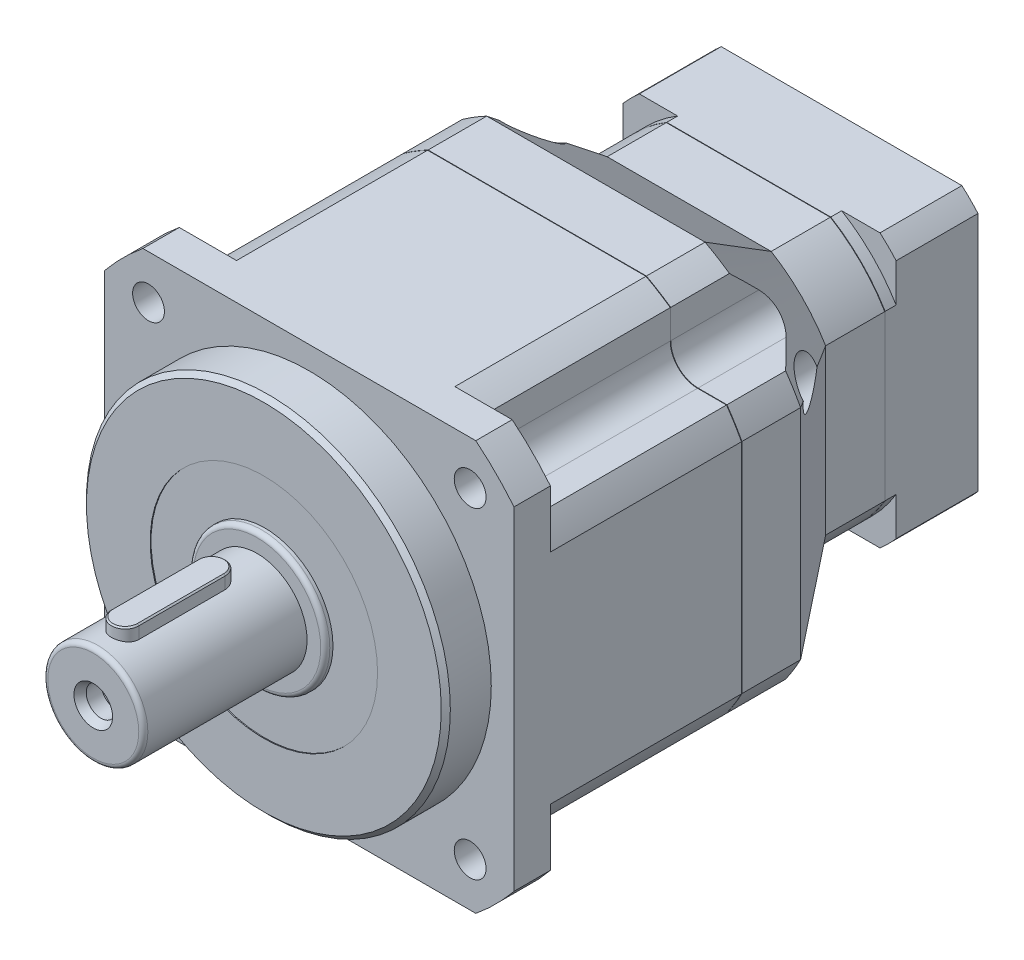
from build123d import *

# Parameters (mm, degrees)
EXTRUDE_1_DEPTH           = 8
SKETCH_2_R                = 40
EXTRUDE_2_DEPTH           = 10
EXTRUDE_3_DEPTH           = 42
SKETCH_4_W                = 18.129172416
SKETCH_4_H                = 19.567995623
CUT_EXTRUDE_1_DEPTH       = 42
PATTERN_CIRCULAR_1_COUNT  = 4
FILLET_1_R                = 6
SKETCH_5_R                = 3.5
CUT_EXTRUDE_2_DEPTH       = 42
PATTERN_CIRCULAR_2_COUNT  = 4
EXTRUDE_4_DEPTH           = 12.9
EXTRUDE_5_DEPTH           = 13
CUT_EXTRUDE_3_DEPTH       = 30
PATTERN_CIRCULAR_3_COUNT  = 4
EXTRUDE_6_DEPTH           = 2.4
EXTRUDE_START             = 18
EXTRUDE_7_DEPTH           = 18
SKETCH_13_R               = 25
CUT_EXTRUDE_4_DEPTH       = 5
SKETCH_14_R               = 4
CUT_EXTRUDE_5_DEPTH       = 12
PATTERN_CIRCULAR_4_COUNT  = 4
SKETCH_15_R               = 4
CUT_EXTRUDE_6_DEPTH       = 12
PATTERN_CIRCULAR_5_COUNT  = 2
SKETCH_16_R               = 19
CUT_EXTRUDE_7_DEPTH       = 13
SKETCH_17_R               = 16.5
EXTRUDE_8_DEPTH           = 11.5
CHAMFER_1_SIZE            = 1
SKETCH_18_W               = 35.787467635
SKETCH_18_H               = 1
CUT_EXTRUDE_8_DEPTH       = 11.5
SKETCH_19_R               = 7
CUT_EXTRUDE_9_DEPTH       = 34
PATTERN_CIRCULAR_6_COUNT  = 4
SKETCH_22_R               = 3
EXTRUDE_9_DEPTH           = 6
PATTERN_CIRCULAR_7_COUNT  = 4
SKETCH_23_R               = 3
EXTRUDE_10_DEPTH          = 6
PATTERN_CIRCULAR_8_COUNT  = 2
SKETCH_24_R               = 15
EXTRUDE_11_DEPTH          = 1.5
SKETCH_25_R               = 11
EXTRUDE_12_DEPTH          = 36
FILLET_3_R                = 1
FILLET_4_R                = 1
CUT_EXTRUDE_START         = -0.2
SKETCH_26_R               = 25
SKETCH_26_R_2             = 15
CUT_EXTRUDE_10_DEPTH      = 0.2
CHAMFER_2_SIZE            = 1
EXTRUDE_13_DEPTH          = 13.5
CHAMFER_3_SIZE            = 0.3
SKETCH_28_R               = 4.5
CUT_EXTRUDE_11_DEPTH      = 20
PATTERN_CIRCULAR_9_COUNT  = 4
SKETCH_29_R               = 3.5
EXTRUDE_14_DEPTH          = 7
PATTERN_CIRCULAR_10_COUNT = 4
SKETCH_30_R               = 3.25
CUT_EXTRUDE_12_DEPTH      = 5
SKETCH_31_R               = 3.25
SKETCH_32_R               = 4.25


with BuildPart() as part:
    # Sketch 1 → Extrude 1 (new body)
    with BuildSketch(Plane.XY):
        with BuildLine():
            Line((-36.592348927, 45), (36.592348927, 45))
            ThreePointArc((36.592348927, 45), (41.012193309, 41.012193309), (45, 36.592348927))
            Line((45, 36.592348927), (45, -36.592348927))
            ThreePointArc((45, -36.592348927), (41.012193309, -41.012193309), (36.592348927, -45))
            Line((36.592348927, -45), (-36.592348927, -45))
            ThreePointArc((-36.592348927, -45), (-41.012193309, -41.012193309), (-45, -36.592348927))
            Line((-45, -36.592348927), (-45, 36.592348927))
            ThreePointArc((-45, 36.592348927), (-41.012193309, 41.012193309), (-36.592348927, 45))
        make_face()
    extrude(amount=EXTRUDE_1_DEPTH)

    # Sketch 2 → Extrude 2 (add)
    with BuildSketch(Plane.XY.offset(8)):
        Circle(SKETCH_2_R)
    extrude(amount=EXTRUDE_2_DEPTH)

    # Sketch 3 → Extrude 3 (add)
    with BuildSketch(Plane(origin=(0, 0, 0), x_dir=(-1, 0, 0), z_dir=(0, 0, -1))):
        with BuildLine():
            Line((-24, 45), (24, 45))
            ThreePointArc((24, 45), (36.062445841, 36.062445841), (45, 24))
            Line((45, 24), (45, -24))
            ThreePointArc((45, -24), (36.062445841, -36.062445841), (24, -45))
            Line((24, -45), (-24, -45))
            ThreePointArc((-24, -45), (-36.062445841, -36.062445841), (-45, -24))
            Line((-45, -24), (-45, 24))
            ThreePointArc((-45, 24), (-36.062445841, 36.062445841), (-24, 45))
        make_face()
    extrude(amount=EXTRUDE_3_DEPTH)

    # Sketch 4 → Cut-Extrude 1 (cut)
    with BuildSketch(Plane(origin=(0, 0, -42), x_dir=(-1, 0, 0), z_dir=(0, 0, -1))):
        with Locations((-38.414586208, 39.133997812)):
            Rectangle(SKETCH_4_W, SKETCH_4_H)
    cut_extrude_1 = extrude(amount=-CUT_EXTRUDE_1_DEPTH, mode=Mode.SUBTRACT)

    # Pattern Circular 1: Cut-Extrude 1 ×4 about axis
    pattern_circular_1_axis = Axis((0, 0, 0), (0, 0, 1))
    for i in range(1, PATTERN_CIRCULAR_1_COUNT):
        add(cut_extrude_1.rotate(pattern_circular_1_axis, i * 360 / PATTERN_CIRCULAR_1_COUNT), mode=Mode.SUBTRACT)

    # Fillet 1
    fillet_1_edges = [part.edges().sort_by_distance(p)[0] for p in [
        (-29.35, -29.35, -21),
        (29.35, -29.35, -21),
        (29.35, 29.35, -21),
        (-29.35, 29.35, -21),
    ]]
    fillet(fillet_1_edges, radius=FILLET_1_R)

    # Sketch 5 → Cut-Extrude 2 (cut)
    with BuildSketch(Plane(origin=(0, 0, 0), x_dir=(-1, 0, 0), z_dir=(0, 0, -1))):
        with Locations((-35.355339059, 35.355339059)):
            Circle(SKETCH_5_R)
    cut_extrude_2 = extrude(amount=-CUT_EXTRUDE_2_DEPTH, mode=Mode.SUBTRACT)

    # Pattern Circular 2: Cut-Extrude 2 ×4 about axis
    pattern_circular_2_axis = Axis((0, 0, 0), (0, 0, 1))
    for i in range(1, PATTERN_CIRCULAR_2_COUNT):
        add(cut_extrude_2.rotate(pattern_circular_2_axis, i * 360 / PATTERN_CIRCULAR_2_COUNT), mode=Mode.SUBTRACT)

    # Sketch 24 → Extrude 11 (add)
    with BuildSketch(Plane.XY.offset(18)):
        Circle(SKETCH_24_R)
    extrude(amount=EXTRUDE_11_DEPTH)

    # Sketch 25 → Extrude 12 (add)
    with BuildSketch(Plane.XY.offset(19.5)):
        Circle(SKETCH_25_R)
    extrude(amount=EXTRUDE_12_DEPTH)

    # Fillet 3
    fillet_3_edges = [part.edges().sort_by_distance(p)[0] for p in [
        (-11, 0, 55.5),
    ]]
    fillet(fillet_3_edges, radius=FILLET_3_R)

    # Fillet 4
    fillet_4_edges = [part.edges().sort_by_distance(p)[0] for p in [
        (-15, 0, 19.5),
    ]]
    fillet(fillet_4_edges, radius=FILLET_4_R)

    # Sketch 26 → Cut-Extrude 10 (cut)
    with BuildSketch(Plane.XY.offset(18).offset(CUT_EXTRUDE_START)):
        Circle(SKETCH_26_R)
        Circle(SKETCH_26_R_2, mode=Mode.SUBTRACT)
    extrude(amount=CUT_EXTRUDE_10_DEPTH, mode=Mode.SUBTRACT)

    # Chamfer 2
    chamfer_2_edges = [part.edges().sort_by_distance(p)[0] for p in [
        (-40, 0, 18),
    ]]
    chamfer(chamfer_2_edges, length=CHAMFER_2_SIZE)

    # Sketch 27 → Extrude 13 (add)
    with BuildSketch(Plane(origin=(0, 0, 0), x_dir=(1, 0, 0), z_dir=(0, 1, 0))):
        with BuildLine():
            Line((-3, -29.5), (-3, -48.5))
            ThreePointArc((-3, -48.5), (0, -51.5), (3, -48.5))
            Line((3, -48.5), (3, -29.5))
            ThreePointArc((3, -29.5), (0, -26.5), (-3, -29.5))
        make_face()
    extrude(amount=EXTRUDE_13_DEPTH)

    # Chamfer 3
    chamfer_3_edges = [part.edges().sort_by_distance(p)[0] for p in [
        (0, 13.5, 26.5),
        (-3, 13.5, 39),
        (0, 13.5, 51.5),
        (3, 13.5, 39),
    ]]
    chamfer(chamfer_3_edges, length=CHAMFER_3_SIZE)

    # Sketch 30 → Cut-Extrude 12 (cut)
    with BuildSketch(Plane.XY.offset(55.5)):
        Circle(SKETCH_30_R)
    extrude(amount=-CUT_EXTRUDE_12_DEPTH, mode=Mode.SUBTRACT)

    # Sketch 31 → Loft 1 2 section 0
    with BuildSketch(Plane.XY.offset(53.8)):
        Circle(SKETCH_31_R)
    # Sketch 32 → Loft 1 2 section 1
    with BuildSketch(Plane.XY.offset(55.5)):
        Circle(SKETCH_32_R)
    loft(mode=Mode.SUBTRACT)

    # Sketch 33 → Hole Wizard M5 _1 (revolve, cut)
    with BuildSketch(Plane(origin=(0, 0, 50.5), x_dir=(0, -1, 0), z_dir=(1, 0, 0))):
        Polygon((0, 0), (0, 18.2618073), (2.1, 17), (2.1, 0), align=None)
    revolve(axis=Axis((0, 0, 56.85), (0, 0, -1)), mode=Mode.SUBTRACT)


with BuildPart() as body_2:
    # Sketch 7 → Extrude 4 (new body)
    with BuildSketch(Plane(origin=(0, 0, -42.1), x_dir=(-1, 0, 0), z_dir=(0, 0, -1))):
        with BuildLine():
            Line((-24, 45), (24, 45))
            ThreePointArc((24, 45), (36.062445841, 36.062445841), (45, 24))
            Line((45, 24), (45, -24))
            ThreePointArc((45, -24), (36.062445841, -36.062445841), (24, -45))
            Line((24, -45), (-24, -45))
            ThreePointArc((-24, -45), (-36.062445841, -36.062445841), (-45, -24))
            Line((-45, -24), (-45, 24))
            ThreePointArc((-45, 24), (-36.062445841, 36.062445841), (-24, 45))
        make_face()
    extrude(amount=EXTRUDE_4_DEPTH)


with BuildPart() as body_3:
    # Sketch 10 → Extrude 5 (new body)
    with BuildSketch(Plane(origin=(0, 0, -75.5), x_dir=(-1, 0, 0), z_dir=(0, 0, -1))):
        with BuildLine():
            Line((-18.027756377, 30), (18.027756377, 30))
            ThreePointArc((18.027756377, 30), (24.748737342, 24.748737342), (30, 18.027756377))
            Line((30, 18.027756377), (30, -18.027756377))
            ThreePointArc((30, -18.027756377), (24.748737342, -24.748737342), (18.027756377, -30))
            Line((18.027756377, -30), (-18.027756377, -30))
            ThreePointArc((-18.027756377, -30), (-24.748737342, -24.748737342), (-30, -18.027756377))
            Line((-30, -18.027756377), (-30, 18.027756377))
            ThreePointArc((-30, 18.027756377), (-24.748737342, 24.748737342), (-18.027756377, 30))
        make_face()
    extrude(amount=EXTRUDE_5_DEPTH)


    add(body_2.part)  # loft_1 joins it to this body
    # loft from a face of the part (loft_1)
    loft([body_3.faces().sort_by_distance((0, 0, -75.5))[0], body_3.faces().sort_by_distance((0, 0, -55))[0]])

    # Sketch 9 → Cut-Extrude 3 (cut)
    with BuildSketch(Plane.XY.offset(-42.1)):
        with BuildLine():
            Line((29.35, 35.35), (29.35, 41.708242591))
            ThreePointArc((29.35, 41.708242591), (36.062445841, 36.062445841), (41.708242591, 29.35))
            Line((41.708242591, 29.35), (35.35, 29.35))
            ThreePointArc((35.35, 29.35), (31.107359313, 31.107359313), (29.35, 35.35))
        make_face()
    cut_extrude_3 = extrude(amount=-CUT_EXTRUDE_3_DEPTH, mode=Mode.SUBTRACT)

    # Pattern Circular 3: Cut-Extrude 3 ×4 about axis
    pattern_circular_3_axis = Axis((0, 0, 0), (0, 0, 1))
    for i in range(1, PATTERN_CIRCULAR_3_COUNT):
        add(cut_extrude_3.rotate(pattern_circular_3_axis, i * 360 / PATTERN_CIRCULAR_3_COUNT), mode=Mode.SUBTRACT)


with BuildPart() as body_3_2:
    # Sketch 11 → Extrude 6 (new body)
    with BuildSketch(Plane(origin=(0, 0, -88.6), x_dir=(-1, 0, 0), z_dir=(0, 0, -1))):
        with BuildLine():
            Line((-18.027756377, 30), (18.027756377, 30))
            ThreePointArc((18.027756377, 30), (24.748737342, 24.748737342), (30, 18.027756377))
            Line((30, 18.027756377), (30, -18.027756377))
            ThreePointArc((30, -18.027756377), (24.748737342, -24.748737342), (18.027756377, -30))
            Line((18.027756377, -30), (-18.027756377, -30))
            ThreePointArc((-18.027756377, -30), (-24.748737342, -24.748737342), (-30, -18.027756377))
            Line((-30, -18.027756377), (-30, 18.027756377))
            ThreePointArc((-30, 18.027756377), (-24.748737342, 24.748737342), (-18.027756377, 30))
        make_face()
    extrude(amount=EXTRUDE_6_DEPTH)

    # Sketch 12 → Extrude 7 (add)
    with BuildSketch(Plane(origin=(0, 0, -91), x_dir=(-1, 0, 0), z_dir=(0, 0, -1)).offset(EXTRUDE_START)):
        with BuildLine():
            Line((-26.457513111, 30), (26.457513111, 30))
            ThreePointArc((26.457513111, 30), (28.284271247, 28.284271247), (30, 26.457513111))
            Line((30, 26.457513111), (30, -26.457513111))
            ThreePointArc((30, -26.457513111), (28.284271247, -28.284271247), (26.457513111, -30))
            Line((26.457513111, -30), (-26.457513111, -30))
            ThreePointArc((-26.457513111, -30), (-28.284271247, -28.284271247), (-30, -26.457513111))
            Line((-30, -26.457513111), (-30, 26.457513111))
            ThreePointArc((-30, 26.457513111), (-28.284271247, 28.284271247), (-26.457513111, 30))
        make_face()
    extrude(amount=-EXTRUDE_7_DEPTH)

    # Sketch 13 → Cut-Extrude 4 (cut)
    with BuildSketch(Plane(origin=(0, 0, -109), x_dir=(-1, 0, 0), z_dir=(0, 0, -1))):
        Circle(SKETCH_13_R)
    extrude(amount=-CUT_EXTRUDE_4_DEPTH, mode=Mode.SUBTRACT)

    # Sketch 14 → Cut-Extrude 5 (cut)
    with BuildSketch(Plane(origin=(0, 0, -109), x_dir=(-1, 0, 0), z_dir=(0, 0, -1))):
        with Locations((6.470476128, -24.148145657)):
            Circle(SKETCH_14_R)
    cut_extrude_5 = extrude(amount=-CUT_EXTRUDE_5_DEPTH, mode=Mode.SUBTRACT)

    # Pattern Circular 4: Cut-Extrude 5 ×4 about axis
    pattern_circular_4_axis = Axis((0, 0, 0), (0, 0, 1))
    for i in range(1, PATTERN_CIRCULAR_4_COUNT):
        add(cut_extrude_5.rotate(pattern_circular_4_axis, i * 360 / PATTERN_CIRCULAR_4_COUNT), mode=Mode.SUBTRACT)

    # Sketch 15 → Cut-Extrude 6 (cut)
    with BuildSketch(Plane(origin=(0, 0, -109), x_dir=(-1, 0, 0), z_dir=(0, 0, -1))):
        with Locations((-16.627194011, -18.669130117)):
            Circle(SKETCH_15_R)
    cut_extrude_6 = extrude(amount=-CUT_EXTRUDE_6_DEPTH, mode=Mode.SUBTRACT)

    # Pattern Circular 5: Cut-Extrude 6 ×2 about axis
    pattern_circular_5_axis = Axis((0, 0, 0), (0, 0, 1))
    for i in range(1, PATTERN_CIRCULAR_5_COUNT):
        add(cut_extrude_6.rotate(pattern_circular_5_axis, i * 360 / PATTERN_CIRCULAR_5_COUNT), mode=Mode.SUBTRACT)

    # Sketch 16 → Cut-Extrude 7 (cut)
    with BuildSketch(Plane(origin=(0, 0, -104), x_dir=(-1, 0, 0), z_dir=(0, 0, -1))):
        Circle(SKETCH_16_R)
    extrude(amount=-CUT_EXTRUDE_7_DEPTH, mode=Mode.SUBTRACT)

    # Sketch 17 → Extrude 8 (add)
    with BuildSketch(Plane(origin=(0, 0, -102.5), x_dir=(-1, 0, 0), z_dir=(0, 0, -1))):
        Circle(SKETCH_17_R)
    extrude(amount=-EXTRUDE_8_DEPTH)

    # Chamfer 1
    chamfer_1_edges = [body_3_2.edges().sort_by_distance(p)[0] for p in [
        (16.5, 0, -102.5),
    ]]
    chamfer(chamfer_1_edges, length=CHAMFER_1_SIZE)

    # Sketch 18 → Cut-Extrude 8 (cut)
    with BuildSketch(Plane(origin=(0, 0, -102.5), x_dir=(-1, 0, 0), z_dir=(0, 0, -1))):
        with Locations((0.071559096, 0)):
            Rectangle(SKETCH_18_W, SKETCH_18_H)
    extrude(amount=-CUT_EXTRUDE_8_DEPTH, mode=Mode.SUBTRACT)


with BuildPart() as cut_extrude_9_tool:
    # Sketch 19 → Cut-Extrude 9 (new body)
    with BuildSketch(Plane(origin=(0, 0, -109), x_dir=(-1, 0, 0), z_dir=(0, 0, -1))):
        Circle(SKETCH_19_R)
    extrude(amount=-CUT_EXTRUDE_9_DEPTH)


with BuildPart() as body_3_1:
    add(body_3.part)

    # Cut-Extrude 9: cut by cut_extrude_9_tool
    add(cut_extrude_9_tool.part, mode=Mode.SUBTRACT)

    # Sketch 28 → Cut-Extrude 11 (cut)
    with BuildSketch(Plane.XY.offset(-49)):
        with Locations((38.97114317, 22.5)):
            Circle(SKETCH_28_R)
    cut_extrude_11 = extrude(amount=-CUT_EXTRUDE_11_DEPTH, mode=Mode.SUBTRACT)

    # Pattern Circular 9: Cut-Extrude 11 ×4 about axis
    pattern_circular_9_axis = Axis((0, 0, 0), (0, 0, 1))
    for i in range(1, PATTERN_CIRCULAR_9_COUNT):
        add(cut_extrude_11.rotate(pattern_circular_9_axis, i * 360 / PATTERN_CIRCULAR_9_COUNT), mode=Mode.SUBTRACT)

    # Sketch 29 → Extrude 14 (add)
    with BuildSketch(Plane(origin=(0, 0, -49), x_dir=(-1, 0, 0), z_dir=(0, 0, -1))):
        with Locations(Location((-38.97114317, 22.5, 0), (0, 0, 180))):
            Circle(SKETCH_29_R)
        Polygon((-38.090442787, 23.991431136), (-39.82241023, 24.008424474), (-40.703110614, 22.516993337), (-39.851843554, 21.008568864), (-38.11987611, 20.991575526), (-37.239175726, 22.483006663), align=None, mode=Mode.SUBTRACT)
    extrude_14 = extrude(amount=EXTRUDE_14_DEPTH)

    # Pattern Circular 10: Extrude 14 ×4 about axis
    pattern_circular_10_axis = Axis((0, 0, 0), (0, 0, 1))
    for i in range(1, PATTERN_CIRCULAR_10_COUNT):
        add(extrude_14.rotate(pattern_circular_10_axis, i * 360 / PATTERN_CIRCULAR_10_COUNT))


with BuildPart() as body_3_2_1:
    add(body_3_2.part)

    # Cut-Extrude 9: cut by cut_extrude_9_tool
    add(cut_extrude_9_tool.part, mode=Mode.SUBTRACT)

    # Sketch 21 → Hole Wizard M4 _1 (revolve, cut)
    with BuildSketch(Plane(origin=(24.748737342, 24.748737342, -109), x_dir=(0, 1, 0), z_dir=(1, 0, 0))):
        Polygon((0, 0), (0, 16.491420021), (1.65, 15.5), (1.65, 0), align=None)
    hole_wizard_m4_1 = revolve(axis=Axis((24.748737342, 24.748737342, -115.35), (0, 0, 1)), mode=Mode.SUBTRACT)

    # Pattern Circular 6: Hole Wizard M4 _1 ×4 about axis
    pattern_circular_6_axis = Axis((0, 0, 0), (0, 0, 1))
    for i in range(1, PATTERN_CIRCULAR_6_COUNT):
        add(hole_wizard_m4_1.rotate(pattern_circular_6_axis, i * 360 / PATTERN_CIRCULAR_6_COUNT), mode=Mode.SUBTRACT)

    # Sketch 22 → Extrude 9 (add)
    with BuildSketch(Plane(origin=(0, 0, -97), x_dir=(-1, 0, 0), z_dir=(0, 0, -1))):
        with Locations((-6.470476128, 24.148145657)):
            Circle(SKETCH_22_R)
        Polygon((-5.801735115, 25.42725425), (-7.243846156, 25.366846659), (-7.912587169, 24.087738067), (-7.13921714, 22.869037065), (-5.697106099, 22.929444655), (-5.028365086, 24.208553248), align=None, mode=Mode.SUBTRACT)
    extrude_9 = extrude(amount=EXTRUDE_9_DEPTH)

    # Pattern Circular 7: Extrude 9 ×4 about axis
    pattern_circular_7_axis = Axis((0, 0, 0), (0, 0, 1))
    for i in range(1, PATTERN_CIRCULAR_7_COUNT):
        add(extrude_9.rotate(pattern_circular_7_axis, i * 360 / PATTERN_CIRCULAR_7_COUNT))

    # Sketch 23 → Extrude 10 (add)
    with BuildSketch(Plane(origin=(0, 0, -97), x_dir=(-1, 0, 0), z_dir=(0, 0, -1))):
        with Locations((-16.627194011, -18.669130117)):
            Circle(SKETCH_23_R)
        Polygon((-15.965005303, -17.386617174), (-17.406788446, -17.454401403), (-18.068977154, -18.736914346), (-17.289382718, -19.95164306), (-15.847599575, -19.883858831), (-15.185410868, -18.601345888), align=None, mode=Mode.SUBTRACT)
    extrude_10 = extrude(amount=EXTRUDE_10_DEPTH)

    # Pattern Circular 8: Extrude 10 ×2 about axis
    pattern_circular_8_axis = Axis((0, 0, 0), (0, 0, 1))
    for i in range(1, PATTERN_CIRCULAR_8_COUNT):
        add(extrude_10.rotate(pattern_circular_8_axis, i * 360 / PATTERN_CIRCULAR_8_COUNT))


solid = Compound([part.part, body_3_1.part, body_3_2_1.part])
